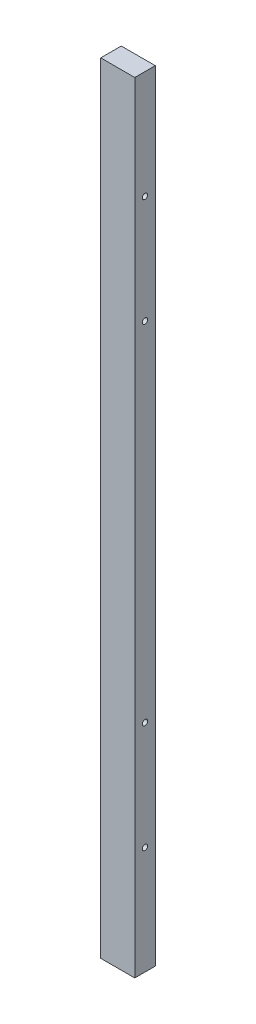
from build123d import *

# Parameters (mm, degrees)
SKETCH1_W           = 63
SKETCH1_H           = 1444
BOSS_EXTRUDE1_DEPTH = 38
CUT_EXTRUDE1_REACH  = 1447.873
SKETCH2_R           = 5


with BuildPart() as part:
    # Sketch1 → Boss-Extrude1 (new body)
    with BuildSketch(Plane.XY):
        with Locations((31.5, 722)):
            Rectangle(SKETCH1_W, SKETCH1_H)
    extrude(amount=BOSS_EXTRUDE1_DEPTH)

    # Sketch2 → Cut-Extrude1 (cut, up to next)
    with BuildSketch(Plane.ZY, mode=Mode.PRIVATE) as cut_extrude1_sk1:
        with Locations((19, 1244)):
            Circle(SKETCH2_R)
    cut_extrude1_tool1 = extrude(cut_extrude1_sk1.sketch, amount=-CUT_EXTRUDE1_REACH, mode=Mode.PRIVATE) & part.part
    # Sketch2 → Cut-Extrude1 (cut, up to next)
    with BuildSketch(Plane.ZY, mode=Mode.PRIVATE) as cut_extrude1_sk2:
        with Locations((19, 1044)):
            Circle(SKETCH2_R)
    cut_extrude1_tool2 = extrude(cut_extrude1_sk2.sketch, amount=-CUT_EXTRUDE1_REACH, mode=Mode.PRIVATE) & part.part
    # Sketch2 → Cut-Extrude1 (cut, up to next)
    with BuildSketch(Plane.ZY, mode=Mode.PRIVATE) as cut_extrude1_sk3:
        with Locations((19, 200)):
            Circle(SKETCH2_R)
    cut_extrude1_tool3 = extrude(cut_extrude1_sk3.sketch, amount=-CUT_EXTRUDE1_REACH, mode=Mode.PRIVATE) & part.part
    # Sketch2 → Cut-Extrude1 (cut, up to next)
    with BuildSketch(Plane.ZY, mode=Mode.PRIVATE) as cut_extrude1_sk4:
        with Locations((19, 400)):
            Circle(SKETCH2_R)
    cut_extrude1_tool4 = extrude(cut_extrude1_sk4.sketch, amount=-CUT_EXTRUDE1_REACH, mode=Mode.PRIVATE) & part.part
    add(cut_extrude1_tool1.solids().sort_by_distance((0, 1244, 19))[0], mode=Mode.SUBTRACT)
    add(cut_extrude1_tool2.solids().sort_by_distance((0, 1044, 19))[0], mode=Mode.SUBTRACT)
    add(cut_extrude1_tool3.solids().sort_by_distance((0, 200, 19))[0], mode=Mode.SUBTRACT)
    add(cut_extrude1_tool4.solids().sort_by_distance((0, 400, 19))[0], mode=Mode.SUBTRACT)


solid = part.part
